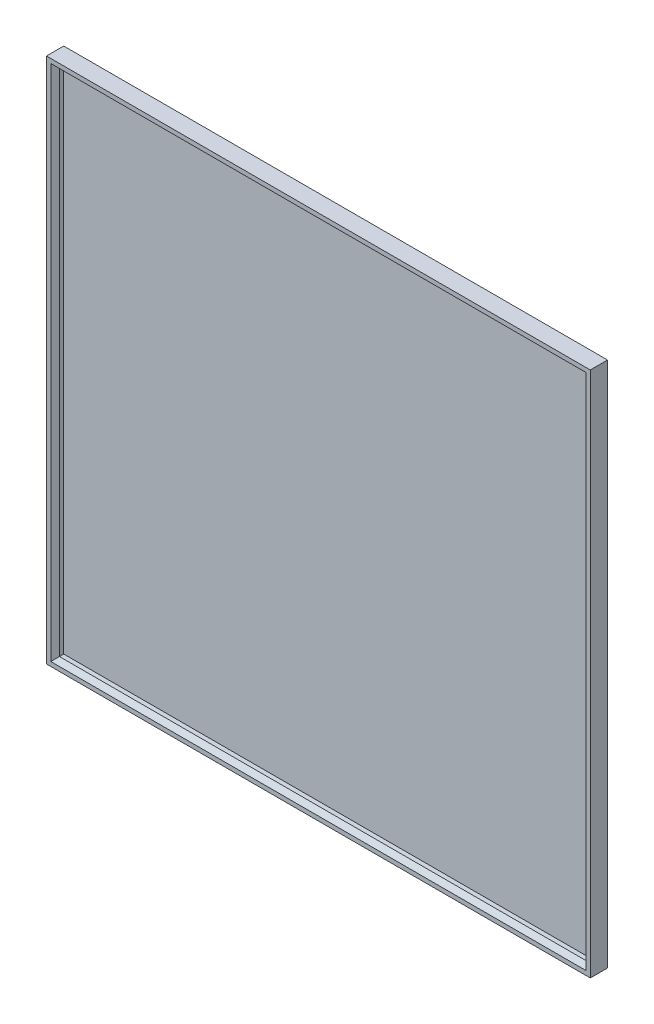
ISO-10303-21;
HEADER;
FILE_DESCRIPTION(('STEP AP214'),'2;1');
FILE_NAME('part.step','',(''),(''),'','','');
FILE_SCHEMA(('AUTOMOTIVE_DESIGN { 1 0 10303 214 1 1 1 1 }'));
ENDSEC;
DATA;
#1=APPLICATION_CONTEXT('core data for automotive mechanical design processes');
#2=APPLICATION_PROTOCOL_DEFINITION('international standard','automotive_design',2000,#1);
#3=PRODUCT_CONTEXT('',#1,'mechanical');
#4=PRODUCT('Part','Part','',(#3));
#5=PRODUCT_RELATED_PRODUCT_CATEGORY('part','',(#4));
#6=PRODUCT_DEFINITION_FORMATION('','',#4);
#7=PRODUCT_DEFINITION_CONTEXT('part definition',#1,'design');
#8=PRODUCT_DEFINITION('design','',#6,#7);
#9=PRODUCT_DEFINITION_SHAPE('','',#8);
#10=(LENGTH_UNIT() NAMED_UNIT(*) SI_UNIT(.MILLI.,.METRE.));
#11=(NAMED_UNIT(*) PLANE_ANGLE_UNIT() SI_UNIT($,.RADIAN.));
#12=(NAMED_UNIT(*) SI_UNIT($,.STERADIAN.) SOLID_ANGLE_UNIT());
#13=UNCERTAINTY_MEASURE_WITH_UNIT(LENGTH_MEASURE(1.E-05),#10,'distance_accuracy_value','');
#14=(GEOMETRIC_REPRESENTATION_CONTEXT(3) GLOBAL_UNCERTAINTY_ASSIGNED_CONTEXT((#13)) GLOBAL_UNIT_ASSIGNED_CONTEXT((#10,
#11,#12)) REPRESENTATION_CONTEXT('',''));
#15=CARTESIAN_POINT('',(0.,0.,0.));
#16=DIRECTION('',(0.,0.,1.));
#17=DIRECTION('',(1.,0.,0.));
#18=AXIS2_PLACEMENT_3D('',#15,#16,#17);
#19=CARTESIAN_POINT('',(0.,-610.,2.));
#20=DIRECTION('',(0.,0.,1.));
#21=DIRECTION('',(1.,0.,0.));
#22=AXIS2_PLACEMENT_3D('',#19,#20,#21);
#23=PLANE('',#22);
#24=CARTESIAN_POINT('',(60.,-180.,2.));
#25=DIRECTION('',(0.,0.,-1.));
#26=DIRECTION('',(-1.,0.,0.));
#27=AXIS2_PLACEMENT_3D('',#24,#25,#26);
#28=CIRCLE('',#27,10.);
#29=CARTESIAN_POINT('',(60.,-190.,2.));
#30=VERTEX_POINT('',#29);
#31=CARTESIAN_POINT('',(50.,-180.,2.));
#32=VERTEX_POINT('',#31);
#33=EDGE_CURVE('E466',#30,#32,#28,.T.);
#34=ORIENTED_EDGE('',*,*,#33,.F.);
#35=DIRECTION('',(-1.,0.,0.));
#36=VECTOR('',#35,1.);
#37=CARTESIAN_POINT('',(140.,-190.,2.));
#38=LINE('',#37,#36);
#39=CARTESIAN_POINT('',(140.,-190.,2.));
#40=VERTEX_POINT('',#39);
#41=EDGE_CURVE('E471',#40,#30,#38,.T.);
#42=ORIENTED_EDGE('',*,*,#41,.F.);
#43=CARTESIAN_POINT('',(140.,-180.,2.));
#44=DIRECTION('',(0.,0.,-1.));
#45=DIRECTION('',(1.,0.,0.));
#46=AXIS2_PLACEMENT_3D('',#43,#44,#45);
#47=CIRCLE('',#46,10.);
#48=CARTESIAN_POINT('',(150.,-180.,2.));
#49=VERTEX_POINT('',#48);
#50=EDGE_CURVE('E503',#49,#40,#47,.T.);
#51=ORIENTED_EDGE('',*,*,#50,.F.);
#52=DIRECTION('',(0.,-1.,0.));
#53=VECTOR('',#52,1.);
#54=CARTESIAN_POINT('',(150.,-160.,2.));
#55=LINE('',#54,#53);
#56=CARTESIAN_POINT('',(150.,-160.,2.));
#57=VERTEX_POINT('',#56);
#58=EDGE_CURVE('E500',#57,#49,#55,.T.);
#59=ORIENTED_EDGE('',*,*,#58,.F.);
#60=CARTESIAN_POINT('',(140.,-160.,2.));
#61=DIRECTION('',(0.,0.,-1.));
#62=DIRECTION('',(1.,0.,0.));
#63=AXIS2_PLACEMENT_3D('',#60,#61,#62);
#64=CIRCLE('',#63,10.);
#65=CARTESIAN_POINT('',(140.,-150.,2.));
#66=VERTEX_POINT('',#65);
#67=EDGE_CURVE('E497',#66,#57,#64,.T.);
#68=ORIENTED_EDGE('',*,*,#67,.F.);
#69=DIRECTION('',(1.,0.,0.));
#70=VECTOR('',#69,1.);
#71=CARTESIAN_POINT('',(140.,-150.,2.));
#72=LINE('',#71,#70);
#73=CARTESIAN_POINT('',(60.,-150.,2.));
#74=VERTEX_POINT('',#73);
#75=EDGE_CURVE('E494',#74,#66,#72,.T.);
#76=ORIENTED_EDGE('',*,*,#75,.F.);
#77=CARTESIAN_POINT('',(60.,-160.,2.));
#78=DIRECTION('',(0.,0.,-1.));
#79=DIRECTION('',(-1.,0.,0.));
#80=AXIS2_PLACEMENT_3D('',#77,#78,#79);
#81=CIRCLE('',#80,10.);
#82=CARTESIAN_POINT('',(50.,-160.,2.));
#83=VERTEX_POINT('',#82);
#84=EDGE_CURVE('E491',#83,#74,#81,.T.);
#85=ORIENTED_EDGE('',*,*,#84,.F.);
#86=DIRECTION('',(0.,1.,0.));
#87=VECTOR('',#86,1.);
#88=CARTESIAN_POINT('',(50.,-160.,2.));
#89=LINE('',#88,#87);
#90=EDGE_CURVE('E488',#32,#83,#89,.T.);
#91=ORIENTED_EDGE('',*,*,#90,.F.);
#92=EDGE_LOOP('',(#34,#42,#51,#59,#68,#76,#85,#91));
#93=FACE_BOUND('',#92,.T.);
#94=DIRECTION('',(0.,1.,0.));
#95=VECTOR('',#94,1.);
#96=CARTESIAN_POINT('',(620.,0.,2.));
#97=LINE('',#96,#95);
#98=CARTESIAN_POINT('',(620.,-600.,2.));
#99=VERTEX_POINT('',#98);
#100=CARTESIAN_POINT('',(620.,-10.,2.));
#101=VERTEX_POINT('',#100);
#102=EDGE_CURVE('E559',#99,#101,#97,.T.);
#103=ORIENTED_EDGE('',*,*,#102,.F.);
#104=DIRECTION('',(1.,0.,0.));
#105=VECTOR('',#104,1.);
#106=CARTESIAN_POINT('',(0.,-600.,2.));
#107=LINE('',#106,#105);
#108=CARTESIAN_POINT('',(10.0000000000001,-600.,2.));
#109=VERTEX_POINT('',#108);
#110=EDGE_CURVE('E556',#109,#99,#107,.T.);
#111=ORIENTED_EDGE('',*,*,#110,.F.);
#112=DIRECTION('',(0.,-1.,0.));
#113=VECTOR('',#112,1.);
#114=CARTESIAN_POINT('',(10.,0.,2.));
#115=LINE('',#114,#113);
#116=CARTESIAN_POINT('',(10.,-10.,2.));
#117=VERTEX_POINT('',#116);
#118=EDGE_CURVE('E534',#117,#109,#115,.T.);
#119=ORIENTED_EDGE('',*,*,#118,.F.);
#120=DIRECTION('',(-1.,0.,0.));
#121=VECTOR('',#120,1.);
#122=CARTESIAN_POINT('',(0.,-10.,2.));
#123=LINE('',#122,#121);
#124=EDGE_CURVE('E562',#101,#117,#123,.T.);
#125=ORIENTED_EDGE('',*,*,#124,.F.);
#126=EDGE_LOOP('',(#103,#111,#119,#125));
#127=FACE_BOUND('',#126,.T.);
#128=CARTESIAN_POINT('',(490.,-180.,2.));
#129=DIRECTION('',(0.,0.,-1.));
#130=DIRECTION('',(1.,0.,0.));
#131=AXIS2_PLACEMENT_3D('',#128,#129,#130);
#132=CIRCLE('',#131,10.);
#133=CARTESIAN_POINT('',(490.,-190.,2.));
#134=VERTEX_POINT('',#133);
#135=CARTESIAN_POINT('',(480.,-180.,2.));
#136=VERTEX_POINT('',#135);
#137=EDGE_CURVE('E392',#134,#136,#132,.T.);
#138=ORIENTED_EDGE('',*,*,#137,.F.);
#139=DIRECTION('',(-1.,0.,0.));
#140=VECTOR('',#139,1.);
#141=CARTESIAN_POINT('',(570.,-190.,2.));
#142=LINE('',#141,#140);
#143=CARTESIAN_POINT('',(570.,-190.,2.));
#144=VERTEX_POINT('',#143);
#145=EDGE_CURVE('E406',#144,#134,#142,.T.);
#146=ORIENTED_EDGE('',*,*,#145,.F.);
#147=CARTESIAN_POINT('',(570.,-180.,2.));
#148=DIRECTION('',(0.,0.,-1.));
#149=DIRECTION('',(-1.,0.,0.));
#150=AXIS2_PLACEMENT_3D('',#147,#148,#149);
#151=CIRCLE('',#150,10.);
#152=CARTESIAN_POINT('',(580.,-180.,2.));
#153=VERTEX_POINT('',#152);
#154=EDGE_CURVE('E438',#153,#144,#151,.T.);
#155=ORIENTED_EDGE('',*,*,#154,.F.);
#156=DIRECTION('',(0.,-1.,0.));
#157=VECTOR('',#156,1.);
#158=CARTESIAN_POINT('',(580.,-160.,2.));
#159=LINE('',#158,#157);
#160=CARTESIAN_POINT('',(580.,-160.,2.));
#161=VERTEX_POINT('',#160);
#162=EDGE_CURVE('E435',#161,#153,#159,.T.);
#163=ORIENTED_EDGE('',*,*,#162,.F.);
#164=CARTESIAN_POINT('',(570.,-160.,2.));
#165=DIRECTION('',(0.,0.,-1.));
#166=DIRECTION('',(1.,0.,0.));
#167=AXIS2_PLACEMENT_3D('',#164,#165,#166);
#168=CIRCLE('',#167,10.0000000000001);
#169=CARTESIAN_POINT('',(570.,-150.,2.));
#170=VERTEX_POINT('',#169);
#171=EDGE_CURVE('E432',#170,#161,#168,.T.);
#172=ORIENTED_EDGE('',*,*,#171,.F.);
#173=DIRECTION('',(1.,0.,0.));
#174=VECTOR('',#173,1.);
#175=CARTESIAN_POINT('',(570.,-150.,2.));
#176=LINE('',#175,#174);
#177=CARTESIAN_POINT('',(490.,-150.,2.));
#178=VERTEX_POINT('',#177);
#179=EDGE_CURVE('E429',#178,#170,#176,.T.);
#180=ORIENTED_EDGE('',*,*,#179,.F.);
#181=CARTESIAN_POINT('',(490.,-160.,2.));
#182=DIRECTION('',(0.,0.,-1.));
#183=DIRECTION('',(-1.,0.,0.));
#184=AXIS2_PLACEMENT_3D('',#181,#182,#183);
#185=CIRCLE('',#184,10.);
#186=CARTESIAN_POINT('',(480.,-160.,2.));
#187=VERTEX_POINT('',#186);
#188=EDGE_CURVE('E426',#187,#178,#185,.T.);
#189=ORIENTED_EDGE('',*,*,#188,.F.);
#190=DIRECTION('',(0.,1.,0.));
#191=VECTOR('',#190,1.);
#192=CARTESIAN_POINT('',(480.,-160.,2.));
#193=LINE('',#192,#191);
#194=EDGE_CURVE('E423',#136,#187,#193,.T.);
#195=ORIENTED_EDGE('',*,*,#194,.F.);
#196=EDGE_LOOP('',(#138,#146,#155,#163,#172,#180,#189,#195));
#197=FACE_BOUND('',#196,.T.);
#198=ADVANCED_FACE('F31',(#93,#127,#197),#23,.F.);
#199=CARTESIAN_POINT('',(0.,0.,20.));
#200=DIRECTION('',(1.,0.,0.));
#201=DIRECTION('',(0.,1.,0.));
#202=AXIS2_PLACEMENT_3D('',#199,#200,#201);
#203=PLANE('',#202);
#204=DIRECTION('',(0.,-1.,0.));
#205=VECTOR('',#204,1.);
#206=CARTESIAN_POINT('',(0.,0.,0.));
#207=LINE('',#206,#205);
#208=CARTESIAN_POINT('',(0.,0.,0.));
#209=VERTEX_POINT('',#208);
#210=CARTESIAN_POINT('',(0.,-610.,0.));
#211=VERTEX_POINT('',#210);
#212=EDGE_CURVE('E570',#209,#211,#207,.T.);
#213=ORIENTED_EDGE('',*,*,#212,.T.);
#214=DIRECTION('',(0.,0.,-1.));
#215=VECTOR('',#214,1.);
#216=CARTESIAN_POINT('',(0.,-610.,20.));
#217=LINE('',#216,#215);
#218=CARTESIAN_POINT('',(0.,-610.,20.));
#219=VERTEX_POINT('',#218);
#220=EDGE_CURVE('E611',#219,#211,#217,.T.);
#221=ORIENTED_EDGE('',*,*,#220,.F.);
#222=DIRECTION('',(0.,-1.,0.));
#223=VECTOR('',#222,1.);
#224=CARTESIAN_POINT('',(0.,0.,20.));
#225=LINE('',#224,#223);
#226=CARTESIAN_POINT('',(0.,0.,20.));
#227=VERTEX_POINT('',#226);
#228=EDGE_CURVE('E585',#227,#219,#225,.T.);
#229=ORIENTED_EDGE('',*,*,#228,.F.);
#230=DIRECTION('',(0.,0.,-1.));
#231=VECTOR('',#230,1.);
#232=CARTESIAN_POINT('',(0.,0.,20.));
#233=LINE('',#232,#231);
#234=EDGE_CURVE('E595',#227,#209,#233,.T.);
#235=ORIENTED_EDGE('',*,*,#234,.T.);
#236=EDGE_LOOP('',(#213,#221,#229,#235));
#237=FACE_BOUND('',#236,.T.);
#238=ADVANCED_FACE('F686',(#237),#203,.F.);
#239=CARTESIAN_POINT('',(0.,-610.,20.));
#240=DIRECTION('',(0.,1.,0.));
#241=DIRECTION('',(0.,0.,1.));
#242=AXIS2_PLACEMENT_3D('',#239,#240,#241);
#243=PLANE('',#242);
#244=DIRECTION('',(1.,0.,0.));
#245=VECTOR('',#244,1.);
#246=CARTESIAN_POINT('',(0.,-610.,0.));
#247=LINE('',#246,#245);
#248=CARTESIAN_POINT('',(630.,-610.,0.));
#249=VERTEX_POINT('',#248);
#250=EDGE_CURVE('E598',#211,#249,#247,.T.);
#251=ORIENTED_EDGE('',*,*,#250,.T.);
#252=DIRECTION('',(0.,0.,-1.));
#253=VECTOR('',#252,1.);
#254=CARTESIAN_POINT('',(630.,-610.,20.));
#255=LINE('',#254,#253);
#256=CARTESIAN_POINT('',(630.,-610.,20.));
#257=VERTEX_POINT('',#256);
#258=EDGE_CURVE('E608',#257,#249,#255,.T.);
#259=ORIENTED_EDGE('',*,*,#258,.F.);
#260=DIRECTION('',(1.,0.,0.));
#261=VECTOR('',#260,1.);
#262=CARTESIAN_POINT('',(0.,-610.,20.));
#263=LINE('',#262,#261);
#264=EDGE_CURVE('E588',#219,#257,#263,.T.);
#265=ORIENTED_EDGE('',*,*,#264,.F.);
#266=ORIENTED_EDGE('',*,*,#220,.T.);
#267=EDGE_LOOP('',(#251,#259,#265,#266));
#268=FACE_BOUND('',#267,.T.);
#269=ADVANCED_FACE('F691',(#268),#243,.F.);
#270=CARTESIAN_POINT('',(630.,0.,20.));
#271=DIRECTION('',(-1.,0.,0.));
#272=DIRECTION('',(0.,-1.,0.));
#273=AXIS2_PLACEMENT_3D('',#270,#271,#272);
#274=PLANE('',#273);
#275=DIRECTION('',(0.,1.,0.));
#276=VECTOR('',#275,1.);
#277=CARTESIAN_POINT('',(630.,0.,0.));
#278=LINE('',#277,#276);
#279=CARTESIAN_POINT('',(630.,0.,0.));
#280=VERTEX_POINT('',#279);
#281=EDGE_CURVE('E600',#249,#280,#278,.T.);
#282=ORIENTED_EDGE('',*,*,#281,.T.);
#283=DIRECTION('',(0.,0.,-1.));
#284=VECTOR('',#283,1.);
#285=CARTESIAN_POINT('',(630.,0.,20.));
#286=LINE('',#285,#284);
#287=CARTESIAN_POINT('',(630.,0.,20.));
#288=VERTEX_POINT('',#287);
#289=EDGE_CURVE('E605',#288,#280,#286,.T.);
#290=ORIENTED_EDGE('',*,*,#289,.F.);
#291=DIRECTION('',(0.,1.,0.));
#292=VECTOR('',#291,1.);
#293=CARTESIAN_POINT('',(630.,0.,20.));
#294=LINE('',#293,#292);
#295=EDGE_CURVE('E591',#257,#288,#294,.T.);
#296=ORIENTED_EDGE('',*,*,#295,.F.);
#297=ORIENTED_EDGE('',*,*,#258,.T.);
#298=EDGE_LOOP('',(#282,#290,#296,#297));
#299=FACE_BOUND('',#298,.T.);
#300=ADVANCED_FACE('F1046',(#299),#274,.F.);
#301=CARTESIAN_POINT('',(0.,0.,20.));
#302=DIRECTION('',(0.,-1.,0.));
#303=DIRECTION('',(0.,0.,-1.));
#304=AXIS2_PLACEMENT_3D('',#301,#302,#303);
#305=PLANE('',#304);
#306=DIRECTION('',(-1.,0.,0.));
#307=VECTOR('',#306,1.);
#308=CARTESIAN_POINT('',(0.,0.,0.));
#309=LINE('',#308,#307);
#310=EDGE_CURVE('E589',#280,#209,#309,.T.);
#311=ORIENTED_EDGE('',*,*,#310,.T.);
#312=ORIENTED_EDGE('',*,*,#234,.F.);
#313=DIRECTION('',(-1.,0.,0.));
#314=VECTOR('',#313,1.);
#315=CARTESIAN_POINT('',(0.,0.,20.));
#316=LINE('',#315,#314);
#317=EDGE_CURVE('E593',#288,#227,#316,.T.);
#318=ORIENTED_EDGE('',*,*,#317,.F.);
#319=ORIENTED_EDGE('',*,*,#289,.T.);
#320=EDGE_LOOP('',(#311,#312,#318,#319));
#321=FACE_BOUND('',#320,.T.);
#322=ADVANCED_FACE('F1033',(#321),#305,.F.);
#323=CARTESIAN_POINT('',(0.,-610.,20.));
#324=DIRECTION('',(0.,0.,1.));
#325=DIRECTION('',(1.,0.,0.));
#326=AXIS2_PLACEMENT_3D('',#323,#324,#325);
#327=PLANE('',#326);
#328=DIRECTION('',(0.,-1.,0.));
#329=VECTOR('',#328,1.);
#330=CARTESIAN_POINT('',(625.,-610.,20.));
#331=LINE('',#330,#329);
#332=CARTESIAN_POINT('',(625.,-5.,20.));
#333=VERTEX_POINT('',#332);
#334=CARTESIAN_POINT('',(625.,-605.,20.));
#335=VERTEX_POINT('',#334);
#336=EDGE_CURVE('E621',#333,#335,#331,.T.);
#337=ORIENTED_EDGE('',*,*,#336,.T.);
#338=DIRECTION('',(-1.,0.,0.));
#339=VECTOR('',#338,1.);
#340=CARTESIAN_POINT('',(0.,-605.,20.));
#341=LINE('',#340,#339);
#342=CARTESIAN_POINT('',(5.00000000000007,-605.,20.));
#343=VERTEX_POINT('',#342);
#344=EDGE_CURVE('E623',#335,#343,#341,.T.);
#345=ORIENTED_EDGE('',*,*,#344,.T.);
#346=DIRECTION('',(0.,1.,0.));
#347=VECTOR('',#346,1.);
#348=CARTESIAN_POINT('',(5.00000000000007,-610.,20.));
#349=LINE('',#348,#347);
#350=CARTESIAN_POINT('',(5.,-5.,20.));
#351=VERTEX_POINT('',#350);
#352=EDGE_CURVE('E619',#343,#351,#349,.T.);
#353=ORIENTED_EDGE('',*,*,#352,.T.);
#354=DIRECTION('',(1.,0.,0.));
#355=VECTOR('',#354,1.);
#356=CARTESIAN_POINT('',(0.,-5.,20.));
#357=LINE('',#356,#355);
#358=EDGE_CURVE('E617',#351,#333,#357,.T.);
#359=ORIENTED_EDGE('',*,*,#358,.T.);
#360=EDGE_LOOP('',(#337,#345,#353,#359));
#361=FACE_BOUND('',#360,.T.);
#362=ORIENTED_EDGE('',*,*,#228,.T.);
#363=ORIENTED_EDGE('',*,*,#264,.T.);
#364=ORIENTED_EDGE('',*,*,#295,.T.);
#365=ORIENTED_EDGE('',*,*,#317,.T.);
#366=EDGE_LOOP('',(#362,#363,#364,#365));
#367=FACE_BOUND('',#366,.T.);
#368=ADVANCED_FACE('F648',(#361,#367),#327,.T.);
#369=CARTESIAN_POINT('',(0.,-610.,0.));
#370=DIRECTION('',(0.,0.,1.));
#371=DIRECTION('',(1.,0.,0.));
#372=AXIS2_PLACEMENT_3D('',#369,#370,#371);
#373=PLANE('',#372);
#374=DIRECTION('',(-1.,0.,0.));
#375=VECTOR('',#374,1.);
#376=CARTESIAN_POINT('',(0.,-10.,0.));
#377=LINE('',#376,#375);
#378=CARTESIAN_POINT('',(620.,-10.,0.));
#379=VERTEX_POINT('',#378);
#380=CARTESIAN_POINT('',(10.,-10.,0.));
#381=VERTEX_POINT('',#380);
#382=EDGE_CURVE('E539',#379,#381,#377,.T.);
#383=ORIENTED_EDGE('',*,*,#382,.T.);
#384=DIRECTION('',(0.,-1.,0.));
#385=VECTOR('',#384,1.);
#386=CARTESIAN_POINT('',(10.,0.,0.));
#387=LINE('',#386,#385);
#388=CARTESIAN_POINT('',(10.0000000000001,-600.,0.));
#389=VERTEX_POINT('',#388);
#390=EDGE_CURVE('E543',#381,#389,#387,.T.);
#391=ORIENTED_EDGE('',*,*,#390,.T.);
#392=DIRECTION('',(1.,0.,0.));
#393=VECTOR('',#392,1.);
#394=CARTESIAN_POINT('',(0.,-600.,0.));
#395=LINE('',#394,#393);
#396=CARTESIAN_POINT('',(620.,-600.,0.));
#397=VERTEX_POINT('',#396);
#398=EDGE_CURVE('E546',#389,#397,#395,.T.);
#399=ORIENTED_EDGE('',*,*,#398,.T.);
#400=DIRECTION('',(0.,1.,0.));
#401=VECTOR('',#400,1.);
#402=CARTESIAN_POINT('',(620.,0.,0.));
#403=LINE('',#402,#401);
#404=EDGE_CURVE('E549',#397,#379,#403,.T.);
#405=ORIENTED_EDGE('',*,*,#404,.T.);
#406=EDGE_LOOP('',(#383,#391,#399,#405));
#407=FACE_BOUND('',#406,.T.);
#408=ORIENTED_EDGE('',*,*,#212,.F.);
#409=ORIENTED_EDGE('',*,*,#310,.F.);
#410=ORIENTED_EDGE('',*,*,#281,.F.);
#411=ORIENTED_EDGE('',*,*,#250,.F.);
#412=EDGE_LOOP('',(#408,#409,#410,#411));
#413=FACE_BOUND('',#412,.T.);
#414=ADVANCED_FACE('F675',(#407,#413),#373,.F.);
#415=CARTESIAN_POINT('',(10.,0.,20.));
#416=DIRECTION('',(1.,0.,0.));
#417=DIRECTION('',(0.,1.,0.));
#418=AXIS2_PLACEMENT_3D('',#415,#416,#417);
#419=PLANE('',#418);
#420=DIRECTION('',(0.,0.,-1.));
#421=VECTOR('',#420,1.);
#422=CARTESIAN_POINT('',(10.,-10.,20.));
#423=LINE('',#422,#421);
#424=CARTESIAN_POINT('',(10.,-10.,15.));
#425=VERTEX_POINT('',#424);
#426=CARTESIAN_POINT('',(10.,-10.,10.));
#427=VERTEX_POINT('',#426);
#428=EDGE_CURVE('E572',#425,#427,#423,.T.);
#429=ORIENTED_EDGE('',*,*,#428,.F.);
#430=DIRECTION('',(0.,-1.,0.));
#431=VECTOR('',#430,1.);
#432=CARTESIAN_POINT('',(10.,0.,15.));
#433=LINE('',#432,#431);
#434=CARTESIAN_POINT('',(10.0000000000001,-600.,15.));
#435=VERTEX_POINT('',#434);
#436=EDGE_CURVE('E40',#425,#435,#433,.T.);
#437=ORIENTED_EDGE('',*,*,#436,.T.);
#438=DIRECTION('',(0.,0.,-1.));
#439=VECTOR('',#438,1.);
#440=CARTESIAN_POINT('',(10.0000000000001,-600.,20.));
#441=LINE('',#440,#439);
#442=CARTESIAN_POINT('',(10.0000000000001,-600.,10.));
#443=VERTEX_POINT('',#442);
#444=EDGE_CURVE('E568',#435,#443,#441,.T.);
#445=ORIENTED_EDGE('',*,*,#444,.T.);
#446=DIRECTION('',(0.,-1.,0.));
#447=VECTOR('',#446,1.);
#448=CARTESIAN_POINT('',(10.,0.,10.));
#449=LINE('',#448,#447);
#450=EDGE_CURVE('E564',#427,#443,#449,.T.);
#451=ORIENTED_EDGE('',*,*,#450,.F.);
#452=EDGE_LOOP('',(#429,#437,#445,#451));
#453=FACE_BOUND('',#452,.T.);
#454=ADVANCED_FACE('F673',(#453),#419,.T.);
#455=CARTESIAN_POINT('',(0.,-600.,20.));
#456=DIRECTION('',(0.,1.,0.));
#457=DIRECTION('',(0.,0.,1.));
#458=AXIS2_PLACEMENT_3D('',#455,#456,#457);
#459=PLANE('',#458);
#460=ORIENTED_EDGE('',*,*,#444,.F.);
#461=DIRECTION('',(1.,0.,0.));
#462=VECTOR('',#461,1.);
#463=CARTESIAN_POINT('',(0.,-600.,15.));
#464=LINE('',#463,#462);
#465=CARTESIAN_POINT('',(620.,-600.,15.));
#466=VERTEX_POINT('',#465);
#467=EDGE_CURVE('E614',#435,#466,#464,.T.);
#468=ORIENTED_EDGE('',*,*,#467,.T.);
#469=DIRECTION('',(0.,0.,-1.));
#470=VECTOR('',#469,1.);
#471=CARTESIAN_POINT('',(620.,-600.,20.));
#472=LINE('',#471,#470);
#473=CARTESIAN_POINT('',(620.,-600.,10.));
#474=VERTEX_POINT('',#473);
#475=EDGE_CURVE('E571',#466,#474,#472,.T.);
#476=ORIENTED_EDGE('',*,*,#475,.T.);
#477=DIRECTION('',(1.,0.,0.));
#478=VECTOR('',#477,1.);
#479=CARTESIAN_POINT('',(0.,-600.,10.));
#480=LINE('',#479,#478);
#481=EDGE_CURVE('E567',#443,#474,#480,.T.);
#482=ORIENTED_EDGE('',*,*,#481,.F.);
#483=EDGE_LOOP('',(#460,#468,#476,#482));
#484=FACE_BOUND('',#483,.T.);
#485=ADVANCED_FACE('F661',(#484),#459,.T.);
#486=CARTESIAN_POINT('',(620.,0.,20.));
#487=DIRECTION('',(-1.,0.,0.));
#488=DIRECTION('',(0.,-1.,0.));
#489=AXIS2_PLACEMENT_3D('',#486,#487,#488);
#490=PLANE('',#489);
#491=ORIENTED_EDGE('',*,*,#475,.F.);
#492=DIRECTION('',(0.,1.,0.));
#493=VECTOR('',#492,1.);
#494=CARTESIAN_POINT('',(620.,0.,15.));
#495=LINE('',#494,#493);
#496=CARTESIAN_POINT('',(620.,-10.,15.));
#497=VERTEX_POINT('',#496);
#498=EDGE_CURVE('E626',#466,#497,#495,.T.);
#499=ORIENTED_EDGE('',*,*,#498,.T.);
#500=DIRECTION('',(0.,0.,-1.));
#501=VECTOR('',#500,1.);
#502=CARTESIAN_POINT('',(620.,-10.,20.));
#503=LINE('',#502,#501);
#504=CARTESIAN_POINT('',(620.,-10.,10.));
#505=VERTEX_POINT('',#504);
#506=EDGE_CURVE('E574',#497,#505,#503,.T.);
#507=ORIENTED_EDGE('',*,*,#506,.T.);
#508=DIRECTION('',(0.,1.,0.));
#509=VECTOR('',#508,1.);
#510=CARTESIAN_POINT('',(620.,0.,10.));
#511=LINE('',#510,#509);
#512=EDGE_CURVE('E578',#474,#505,#511,.T.);
#513=ORIENTED_EDGE('',*,*,#512,.F.);
#514=EDGE_LOOP('',(#491,#499,#507,#513));
#515=FACE_BOUND('',#514,.T.);
#516=ADVANCED_FACE('F664',(#515),#490,.T.);
#517=CARTESIAN_POINT('',(0.,-10.,20.));
#518=DIRECTION('',(0.,-1.,0.));
#519=DIRECTION('',(0.,0.,-1.));
#520=AXIS2_PLACEMENT_3D('',#517,#518,#519);
#521=PLANE('',#520);
#522=ORIENTED_EDGE('',*,*,#506,.F.);
#523=DIRECTION('',(-1.,0.,0.));
#524=VECTOR('',#523,1.);
#525=CARTESIAN_POINT('',(0.,-10.,15.));
#526=LINE('',#525,#524);
#527=EDGE_CURVE('E11',#497,#425,#526,.T.);
#528=ORIENTED_EDGE('',*,*,#527,.T.);
#529=ORIENTED_EDGE('',*,*,#428,.T.);
#530=DIRECTION('',(-1.,0.,0.));
#531=VECTOR('',#530,1.);
#532=CARTESIAN_POINT('',(0.,-10.,10.));
#533=LINE('',#532,#531);
#534=EDGE_CURVE('E575',#505,#427,#533,.T.);
#535=ORIENTED_EDGE('',*,*,#534,.F.);
#536=EDGE_LOOP('',(#522,#528,#529,#535));
#537=FACE_BOUND('',#536,.T.);
#538=ADVANCED_FACE('F670',(#537),#521,.T.);
#539=CARTESIAN_POINT('',(0.,-610.,10.));
#540=DIRECTION('',(0.,0.,1.));
#541=DIRECTION('',(1.,0.,0.));
#542=AXIS2_PLACEMENT_3D('',#539,#540,#541);
#543=PLANE('',#542);
#544=ORIENTED_EDGE('',*,*,#450,.T.);
#545=ORIENTED_EDGE('',*,*,#481,.T.);
#546=ORIENTED_EDGE('',*,*,#512,.T.);
#547=ORIENTED_EDGE('',*,*,#534,.T.);
#548=EDGE_LOOP('',(#544,#545,#546,#547));
#549=FACE_BOUND('',#548,.T.);
#550=ADVANCED_FACE('F667',(#549),#543,.T.);
#551=CARTESIAN_POINT('',(10.,0.,20.));
#552=DIRECTION('',(1.,0.,0.));
#553=DIRECTION('',(0.,1.,0.));
#554=AXIS2_PLACEMENT_3D('',#551,#552,#553);
#555=PLANE('',#554);
#556=ORIENTED_EDGE('',*,*,#118,.T.);
#557=DIRECTION('',(0.,0.,-1.));
#558=VECTOR('',#557,1.);
#559=CARTESIAN_POINT('',(10.0000000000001,-600.,20.));
#560=LINE('',#559,#558);
#561=EDGE_CURVE('E532',#109,#389,#560,.T.);
#562=ORIENTED_EDGE('',*,*,#561,.T.);
#563=ORIENTED_EDGE('',*,*,#390,.F.);
#564=DIRECTION('',(0.,0.,-1.));
#565=VECTOR('',#564,1.);
#566=CARTESIAN_POINT('',(10.,-10.,20.));
#567=LINE('',#566,#565);
#568=EDGE_CURVE('E536',#117,#381,#567,.T.);
#569=ORIENTED_EDGE('',*,*,#568,.F.);
#570=EDGE_LOOP('',(#556,#562,#563,#569));
#571=FACE_BOUND('',#570,.T.);
#572=ADVANCED_FACE('F707',(#571),#555,.T.);
#573=CARTESIAN_POINT('',(0.,-600.,20.));
#574=DIRECTION('',(0.,1.,0.));
#575=DIRECTION('',(0.,0.,1.));
#576=AXIS2_PLACEMENT_3D('',#573,#574,#575);
#577=PLANE('',#576);
#578=ORIENTED_EDGE('',*,*,#110,.T.);
#579=DIRECTION('',(0.,0.,-1.));
#580=VECTOR('',#579,1.);
#581=CARTESIAN_POINT('',(620.,-600.,20.));
#582=LINE('',#581,#580);
#583=EDGE_CURVE('E535',#99,#397,#582,.T.);
#584=ORIENTED_EDGE('',*,*,#583,.T.);
#585=ORIENTED_EDGE('',*,*,#398,.F.);
#586=ORIENTED_EDGE('',*,*,#561,.F.);
#587=EDGE_LOOP('',(#578,#584,#585,#586));
#588=FACE_BOUND('',#587,.T.);
#589=ADVANCED_FACE('F703',(#588),#577,.T.);
#590=CARTESIAN_POINT('',(620.,0.,20.));
#591=DIRECTION('',(-1.,0.,0.));
#592=DIRECTION('',(0.,-1.,0.));
#593=AXIS2_PLACEMENT_3D('',#590,#591,#592);
#594=PLANE('',#593);
#595=ORIENTED_EDGE('',*,*,#102,.T.);
#596=DIRECTION('',(0.,0.,-1.));
#597=VECTOR('',#596,1.);
#598=CARTESIAN_POINT('',(620.,-10.,20.));
#599=LINE('',#598,#597);
#600=EDGE_CURVE('E538',#101,#379,#599,.T.);
#601=ORIENTED_EDGE('',*,*,#600,.T.);
#602=ORIENTED_EDGE('',*,*,#404,.F.);
#603=ORIENTED_EDGE('',*,*,#583,.F.);
#604=EDGE_LOOP('',(#595,#601,#602,#603));
#605=FACE_BOUND('',#604,.T.);
#606=ADVANCED_FACE('F699',(#605),#594,.T.);
#607=CARTESIAN_POINT('',(0.,-10.,20.));
#608=DIRECTION('',(0.,-1.,0.));
#609=DIRECTION('',(0.,0.,-1.));
#610=AXIS2_PLACEMENT_3D('',#607,#608,#609);
#611=PLANE('',#610);
#612=ORIENTED_EDGE('',*,*,#124,.T.);
#613=ORIENTED_EDGE('',*,*,#568,.T.);
#614=ORIENTED_EDGE('',*,*,#382,.F.);
#615=ORIENTED_EDGE('',*,*,#600,.F.);
#616=EDGE_LOOP('',(#612,#613,#614,#615));
#617=FACE_BOUND('',#616,.T.);
#618=ADVANCED_FACE('F696',(#617),#611,.T.);
#619=CARTESIAN_POINT('',(0.,-10.,15.));
#620=DIRECTION('',(0.,0.707106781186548,-0.707106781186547));
#621=DIRECTION('',(0.,0.707106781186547,0.707106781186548));
#622=AXIS2_PLACEMENT_3D('',#619,#620,#621);
#623=PLANE('',#622);
#624=DIRECTION('',(0.577350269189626,0.577350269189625,0.577350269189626));
#625=VECTOR('',#624,1.);
#626=CARTESIAN_POINT('',(623.333333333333,-6.66666666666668,18.3333333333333));
#627=LINE('',#626,#625);
#628=EDGE_CURVE('E631',#333,#497,#627,.F.);
#629=ORIENTED_EDGE('',*,*,#628,.F.);
#630=ORIENTED_EDGE('',*,*,#358,.F.);
#631=DIRECTION('',(0.577350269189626,-0.577350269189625,-0.577350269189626));
#632=VECTOR('',#631,1.);
#633=CARTESIAN_POINT('',(6.66666666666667,-6.66666666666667,18.3333333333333));
#634=LINE('',#633,#632);
#635=EDGE_CURVE('E35',#425,#351,#634,.F.);
#636=ORIENTED_EDGE('',*,*,#635,.F.);
#637=ORIENTED_EDGE('',*,*,#527,.F.);
#638=EDGE_LOOP('',(#629,#630,#636,#637));
#639=FACE_BOUND('',#638,.T.);
#640=ADVANCED_FACE('F33',(#639),#623,.F.);
#641=CARTESIAN_POINT('',(10.,0.,15.));
#642=DIRECTION('',(-0.707106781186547,0.,-0.707106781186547));
#643=DIRECTION('',(-0.707106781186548,0.,0.707106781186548));
#644=AXIS2_PLACEMENT_3D('',#641,#642,#643);
#645=PLANE('',#644);
#646=ORIENTED_EDGE('',*,*,#635,.T.);
#647=ORIENTED_EDGE('',*,*,#352,.F.);
#648=DIRECTION('',(0.577350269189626,0.577350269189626,-0.577350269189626));
#649=VECTOR('',#648,1.);
#650=CARTESIAN_POINT('',(6.66666666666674,-603.333333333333,18.3333333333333));
#651=LINE('',#650,#649);
#652=EDGE_CURVE('E630',#435,#343,#651,.F.);
#653=ORIENTED_EDGE('',*,*,#652,.F.);
#654=ORIENTED_EDGE('',*,*,#436,.F.);
#655=EDGE_LOOP('',(#646,#647,#653,#654));
#656=FACE_BOUND('',#655,.T.);
#657=ADVANCED_FACE('F642',(#656),#645,.F.);
#658=CARTESIAN_POINT('',(620.,0.,15.));
#659=DIRECTION('',(0.707106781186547,0.,-0.707106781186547));
#660=DIRECTION('',(-0.707106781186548,0.,-0.707106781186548));
#661=AXIS2_PLACEMENT_3D('',#658,#659,#660);
#662=PLANE('',#661);
#663=ORIENTED_EDGE('',*,*,#628,.T.);
#664=ORIENTED_EDGE('',*,*,#498,.F.);
#665=DIRECTION('',(0.577350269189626,-0.577350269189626,0.577350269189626));
#666=VECTOR('',#665,1.);
#667=CARTESIAN_POINT('',(413.333333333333,-393.333333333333,-191.666666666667));
#668=LINE('',#667,#666);
#669=EDGE_CURVE('E531',#335,#466,#668,.F.);
#670=ORIENTED_EDGE('',*,*,#669,.F.);
#671=ORIENTED_EDGE('',*,*,#336,.F.);
#672=EDGE_LOOP('',(#663,#664,#670,#671));
#673=FACE_BOUND('',#672,.T.);
#674=ADVANCED_FACE('F655',(#673),#662,.F.);
#675=CARTESIAN_POINT('',(0.,-600.,15.));
#676=DIRECTION('',(0.,-0.707106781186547,-0.707106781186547));
#677=DIRECTION('',(0.,0.707106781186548,-0.707106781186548));
#678=AXIS2_PLACEMENT_3D('',#675,#676,#677);
#679=PLANE('',#678);
#680=ORIENTED_EDGE('',*,*,#652,.T.);
#681=ORIENTED_EDGE('',*,*,#344,.F.);
#682=ORIENTED_EDGE('',*,*,#669,.T.);
#683=ORIENTED_EDGE('',*,*,#467,.F.);
#684=EDGE_LOOP('',(#680,#681,#682,#683));
#685=FACE_BOUND('',#684,.T.);
#686=ADVANCED_FACE('F653',(#685),#679,.F.);
#687=CARTESIAN_POINT('',(60.,-180.,-18.));
#688=DIRECTION('',(0.,0.,1.));
#689=DIRECTION('',(1.,0.,0.));
#690=AXIS2_PLACEMENT_3D('',#687,#688,#689);
#691=CYLINDRICAL_SURFACE('',#690,10.);
#692=ORIENTED_EDGE('',*,*,#33,.T.);
#693=DIRECTION('',(0.,0.,1.));
#694=VECTOR('',#693,1.);
#695=CARTESIAN_POINT('',(50.,-180.,-18.));
#696=LINE('',#695,#694);
#697=CARTESIAN_POINT('',(50.,-180.,-18.));
#698=VERTEX_POINT('',#697);
#699=EDGE_CURVE('E528',#698,#32,#696,.T.);
#700=ORIENTED_EDGE('',*,*,#699,.F.);
#701=CARTESIAN_POINT('',(60.,-180.,-18.));
#702=DIRECTION('',(0.,0.,-1.));
#703=DIRECTION('',(-1.,0.,0.));
#704=AXIS2_PLACEMENT_3D('',#701,#702,#703);
#705=CIRCLE('',#704,10.);
#706=CARTESIAN_POINT('',(60.,-190.,-18.));
#707=VERTEX_POINT('',#706);
#708=EDGE_CURVE('E467',#707,#698,#705,.T.);
#709=ORIENTED_EDGE('',*,*,#708,.F.);
#710=DIRECTION('',(0.,0.,1.));
#711=VECTOR('',#710,1.);
#712=CARTESIAN_POINT('',(60.,-190.,-18.));
#713=LINE('',#712,#711);
#714=EDGE_CURVE('E485',#707,#30,#713,.T.);
#715=ORIENTED_EDGE('',*,*,#714,.T.);
#716=EDGE_LOOP('',(#692,#700,#709,#715));
#717=FACE_BOUND('',#716,.T.);
#718=ADVANCED_FACE('F712',(#717),#691,.T.);
#719=CARTESIAN_POINT('',(50.,-160.,-18.));
#720=DIRECTION('',(1.,0.,0.));
#721=DIRECTION('',(0.,0.,-1.));
#722=AXIS2_PLACEMENT_3D('',#719,#720,#721);
#723=PLANE('',#722);
#724=ORIENTED_EDGE('',*,*,#90,.T.);
#725=DIRECTION('',(0.,0.,1.));
#726=VECTOR('',#725,1.);
#727=CARTESIAN_POINT('',(50.,-160.,-18.));
#728=LINE('',#727,#726);
#729=CARTESIAN_POINT('',(50.,-160.,-18.));
#730=VERTEX_POINT('',#729);
#731=EDGE_CURVE('E525',#730,#83,#728,.T.);
#732=ORIENTED_EDGE('',*,*,#731,.F.);
#733=DIRECTION('',(0.,1.,0.));
#734=VECTOR('',#733,1.);
#735=CARTESIAN_POINT('',(50.,-160.,-18.));
#736=LINE('',#735,#734);
#737=EDGE_CURVE('E470',#698,#730,#736,.T.);
#738=ORIENTED_EDGE('',*,*,#737,.F.);
#739=ORIENTED_EDGE('',*,*,#699,.T.);
#740=EDGE_LOOP('',(#724,#732,#738,#739));
#741=FACE_BOUND('',#740,.T.);
#742=ADVANCED_FACE('F715',(#741),#723,.F.);
#743=CARTESIAN_POINT('',(60.,-160.,-18.));
#744=DIRECTION('',(0.,0.,1.));
#745=DIRECTION('',(1.,0.,0.));
#746=AXIS2_PLACEMENT_3D('',#743,#744,#745);
#747=CYLINDRICAL_SURFACE('',#746,10.);
#748=ORIENTED_EDGE('',*,*,#84,.T.);
#749=DIRECTION('',(0.,0.,1.));
#750=VECTOR('',#749,1.);
#751=CARTESIAN_POINT('',(60.,-150.,-18.));
#752=LINE('',#751,#750);
#753=CARTESIAN_POINT('',(60.,-150.,-18.));
#754=VERTEX_POINT('',#753);
#755=EDGE_CURVE('E522',#754,#74,#752,.T.);
#756=ORIENTED_EDGE('',*,*,#755,.F.);
#757=CARTESIAN_POINT('',(60.,-160.,-18.));
#758=DIRECTION('',(0.,0.,-1.));
#759=DIRECTION('',(-1.,0.,0.));
#760=AXIS2_PLACEMENT_3D('',#757,#758,#759);
#761=CIRCLE('',#760,10.);
#762=EDGE_CURVE('E473',#730,#754,#761,.T.);
#763=ORIENTED_EDGE('',*,*,#762,.F.);
#764=ORIENTED_EDGE('',*,*,#731,.T.);
#765=EDGE_LOOP('',(#748,#756,#763,#764));
#766=FACE_BOUND('',#765,.T.);
#767=ADVANCED_FACE('F719',(#766),#747,.T.);
#768=CARTESIAN_POINT('',(140.,-150.,-18.));
#769=DIRECTION('',(0.,-1.,0.));
#770=DIRECTION('',(1.,0.,0.));
#771=AXIS2_PLACEMENT_3D('',#768,#769,#770);
#772=PLANE('',#771);
#773=ORIENTED_EDGE('',*,*,#75,.T.);
#774=DIRECTION('',(0.,0.,1.));
#775=VECTOR('',#774,1.);
#776=CARTESIAN_POINT('',(140.,-150.,-18.));
#777=LINE('',#776,#775);
#778=CARTESIAN_POINT('',(140.,-150.,-18.));
#779=VERTEX_POINT('',#778);
#780=EDGE_CURVE('E519',#779,#66,#777,.T.);
#781=ORIENTED_EDGE('',*,*,#780,.F.);
#782=DIRECTION('',(1.,0.,0.));
#783=VECTOR('',#782,1.);
#784=CARTESIAN_POINT('',(140.,-150.,-18.));
#785=LINE('',#784,#783);
#786=EDGE_CURVE('E475',#754,#779,#785,.T.);
#787=ORIENTED_EDGE('',*,*,#786,.F.);
#788=ORIENTED_EDGE('',*,*,#755,.T.);
#789=EDGE_LOOP('',(#773,#781,#787,#788));
#790=FACE_BOUND('',#789,.T.);
#791=ADVANCED_FACE('F723',(#790),#772,.F.);
#792=CARTESIAN_POINT('',(140.,-160.,-18.));
#793=DIRECTION('',(0.,0.,1.));
#794=DIRECTION('',(1.,0.,0.));
#795=AXIS2_PLACEMENT_3D('',#792,#793,#794);
#796=CYLINDRICAL_SURFACE('',#795,10.);
#797=ORIENTED_EDGE('',*,*,#67,.T.);
#798=DIRECTION('',(0.,0.,1.));
#799=VECTOR('',#798,1.);
#800=CARTESIAN_POINT('',(150.,-160.,-18.));
#801=LINE('',#800,#799);
#802=CARTESIAN_POINT('',(150.,-160.,-18.));
#803=VERTEX_POINT('',#802);
#804=EDGE_CURVE('E516',#803,#57,#801,.T.);
#805=ORIENTED_EDGE('',*,*,#804,.F.);
#806=CARTESIAN_POINT('',(140.,-160.,-18.));
#807=DIRECTION('',(0.,0.,-1.));
#808=DIRECTION('',(1.,0.,0.));
#809=AXIS2_PLACEMENT_3D('',#806,#807,#808);
#810=CIRCLE('',#809,10.);
#811=EDGE_CURVE('E477',#779,#803,#810,.T.);
#812=ORIENTED_EDGE('',*,*,#811,.F.);
#813=ORIENTED_EDGE('',*,*,#780,.T.);
#814=EDGE_LOOP('',(#797,#805,#812,#813));
#815=FACE_BOUND('',#814,.T.);
#816=ADVANCED_FACE('F727',(#815),#796,.T.);
#817=CARTESIAN_POINT('',(150.,-160.,-18.));
#818=DIRECTION('',(-1.,0.,0.));
#819=DIRECTION('',(0.,0.,1.));
#820=AXIS2_PLACEMENT_3D('',#817,#818,#819);
#821=PLANE('',#820);
#822=ORIENTED_EDGE('',*,*,#58,.T.);
#823=DIRECTION('',(0.,0.,1.));
#824=VECTOR('',#823,1.);
#825=CARTESIAN_POINT('',(150.,-180.,-18.));
#826=LINE('',#825,#824);
#827=CARTESIAN_POINT('',(150.,-180.,-18.));
#828=VERTEX_POINT('',#827);
#829=EDGE_CURVE('E513',#828,#49,#826,.T.);
#830=ORIENTED_EDGE('',*,*,#829,.F.);
#831=DIRECTION('',(0.,-1.,0.));
#832=VECTOR('',#831,1.);
#833=CARTESIAN_POINT('',(150.,-160.,-18.));
#834=LINE('',#833,#832);
#835=EDGE_CURVE('E479',#803,#828,#834,.T.);
#836=ORIENTED_EDGE('',*,*,#835,.F.);
#837=ORIENTED_EDGE('',*,*,#804,.T.);
#838=EDGE_LOOP('',(#822,#830,#836,#837));
#839=FACE_BOUND('',#838,.T.);
#840=ADVANCED_FACE('F731',(#839),#821,.F.);
#841=CARTESIAN_POINT('',(140.,-180.,-18.));
#842=DIRECTION('',(0.,0.,1.));
#843=DIRECTION('',(1.,0.,0.));
#844=AXIS2_PLACEMENT_3D('',#841,#842,#843);
#845=CYLINDRICAL_SURFACE('',#844,10.);
#846=ORIENTED_EDGE('',*,*,#50,.T.);
#847=DIRECTION('',(0.,0.,1.));
#848=VECTOR('',#847,1.);
#849=CARTESIAN_POINT('',(140.,-190.,-18.));
#850=LINE('',#849,#848);
#851=CARTESIAN_POINT('',(140.,-190.,-18.));
#852=VERTEX_POINT('',#851);
#853=EDGE_CURVE('E510',#852,#40,#850,.T.);
#854=ORIENTED_EDGE('',*,*,#853,.F.);
#855=CARTESIAN_POINT('',(140.,-180.,-18.));
#856=DIRECTION('',(0.,0.,-1.));
#857=DIRECTION('',(1.,0.,0.));
#858=AXIS2_PLACEMENT_3D('',#855,#856,#857);
#859=CIRCLE('',#858,10.);
#860=EDGE_CURVE('E481',#828,#852,#859,.T.);
#861=ORIENTED_EDGE('',*,*,#860,.F.);
#862=ORIENTED_EDGE('',*,*,#829,.T.);
#863=EDGE_LOOP('',(#846,#854,#861,#862));
#864=FACE_BOUND('',#863,.T.);
#865=ADVANCED_FACE('F735',(#864),#845,.T.);
#866=CARTESIAN_POINT('',(140.,-190.,-18.));
#867=DIRECTION('',(0.,1.,0.));
#868=DIRECTION('',(0.,0.,1.));
#869=AXIS2_PLACEMENT_3D('',#866,#867,#868);
#870=PLANE('',#869);
#871=ORIENTED_EDGE('',*,*,#41,.T.);
#872=ORIENTED_EDGE('',*,*,#714,.F.);
#873=DIRECTION('',(-1.,0.,0.));
#874=VECTOR('',#873,1.);
#875=CARTESIAN_POINT('',(140.,-190.,-18.));
#876=LINE('',#875,#874);
#877=EDGE_CURVE('E483',#852,#707,#876,.T.);
#878=ORIENTED_EDGE('',*,*,#877,.F.);
#879=ORIENTED_EDGE('',*,*,#853,.T.);
#880=EDGE_LOOP('',(#871,#872,#878,#879));
#881=FACE_BOUND('',#880,.T.);
#882=ADVANCED_FACE('F739',(#881),#870,.F.);
#883=CARTESIAN_POINT('',(60.,-180.,-18.));
#884=DIRECTION('',(0.,0.,-1.));
#885=DIRECTION('',(-1.,0.,0.));
#886=AXIS2_PLACEMENT_3D('',#883,#884,#885);
#887=PLANE('',#886);
#888=DIRECTION('',(0.,-1.,0.));
#889=VECTOR('',#888,1.);
#890=CARTESIAN_POINT('',(135.,-170.,-18.));
#891=LINE('',#890,#889);
#892=CARTESIAN_POINT('',(135.,-170.,-18.));
#893=VERTEX_POINT('',#892);
#894=CARTESIAN_POINT('',(135.,-180.,-18.));
#895=VERTEX_POINT('',#894);
#896=EDGE_CURVE('E48',#893,#895,#891,.T.);
#897=ORIENTED_EDGE('',*,*,#896,.F.);
#898=DIRECTION('',(1.,0.,0.));
#899=VECTOR('',#898,1.);
#900=CARTESIAN_POINT('',(135.,-170.,-18.));
#901=LINE('',#900,#899);
#902=CARTESIAN_POINT('',(65.,-170.,-18.));
#903=VERTEX_POINT('',#902);
#904=EDGE_CURVE('E322',#903,#893,#901,.T.);
#905=ORIENTED_EDGE('',*,*,#904,.F.);
#906=DIRECTION('',(0.,1.,0.));
#907=VECTOR('',#906,1.);
#908=CARTESIAN_POINT('',(65.,-170.,-18.));
#909=LINE('',#908,#907);
#910=CARTESIAN_POINT('',(65.,-180.,-18.));
#911=VERTEX_POINT('',#910);
#912=EDGE_CURVE('E325',#911,#903,#909,.T.);
#913=ORIENTED_EDGE('',*,*,#912,.F.);
#914=CARTESIAN_POINT('',(70.,-180.,-18.));
#915=DIRECTION('',(0.,0.,-1.));
#916=DIRECTION('',(1.,0.,0.));
#917=AXIS2_PLACEMENT_3D('',#914,#915,#916);
#918=CIRCLE('',#917,5.);
#919=CARTESIAN_POINT('',(70.,-185.,-18.));
#920=VERTEX_POINT('',#919);
#921=EDGE_CURVE('E341',#920,#911,#918,.T.);
#922=ORIENTED_EDGE('',*,*,#921,.F.);
#923=DIRECTION('',(-1.,0.,0.));
#924=VECTOR('',#923,1.);
#925=CARTESIAN_POINT('',(130.,-185.,-18.));
#926=LINE('',#925,#924);
#927=CARTESIAN_POINT('',(130.,-185.,-18.));
#928=VERTEX_POINT('',#927);
#929=EDGE_CURVE('E338',#928,#920,#926,.T.);
#930=ORIENTED_EDGE('',*,*,#929,.F.);
#931=CARTESIAN_POINT('',(130.,-180.,-18.));
#932=DIRECTION('',(0.,0.,-1.));
#933=DIRECTION('',(-1.,0.,0.));
#934=AXIS2_PLACEMENT_3D('',#931,#932,#933);
#935=CIRCLE('',#934,5.00000000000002);
#936=EDGE_CURVE('E336',#895,#928,#935,.T.);
#937=ORIENTED_EDGE('',*,*,#936,.F.);
#938=EDGE_LOOP('',(#897,#905,#913,#922,#930,#937));
#939=FACE_BOUND('',#938,.T.);
#940=ORIENTED_EDGE('',*,*,#708,.T.);
#941=ORIENTED_EDGE('',*,*,#737,.T.);
#942=ORIENTED_EDGE('',*,*,#762,.T.);
#943=ORIENTED_EDGE('',*,*,#786,.T.);
#944=ORIENTED_EDGE('',*,*,#811,.T.);
#945=ORIENTED_EDGE('',*,*,#835,.T.);
#946=ORIENTED_EDGE('',*,*,#860,.T.);
#947=ORIENTED_EDGE('',*,*,#877,.T.);
#948=EDGE_LOOP('',(#940,#941,#942,#943,#944,#945,#946,#947));
#949=FACE_BOUND('',#948,.T.);
#950=ADVANCED_FACE('F743',(#939,#949),#887,.T.);
#951=CARTESIAN_POINT('',(490.,-180.,-18.));
#952=DIRECTION('',(0.,0.,1.));
#953=DIRECTION('',(1.,0.,0.));
#954=AXIS2_PLACEMENT_3D('',#951,#952,#953);
#955=CYLINDRICAL_SURFACE('',#954,10.);
#956=ORIENTED_EDGE('',*,*,#137,.T.);
#957=DIRECTION('',(0.,0.,1.));
#958=VECTOR('',#957,1.);
#959=CARTESIAN_POINT('',(480.,-180.,-18.));
#960=LINE('',#959,#958);
#961=CARTESIAN_POINT('',(480.,-180.,-18.));
#962=VERTEX_POINT('',#961);
#963=EDGE_CURVE('E463',#962,#136,#960,.T.);
#964=ORIENTED_EDGE('',*,*,#963,.F.);
#965=CARTESIAN_POINT('',(490.,-180.,-18.));
#966=DIRECTION('',(0.,0.,-1.));
#967=DIRECTION('',(1.,0.,0.));
#968=AXIS2_PLACEMENT_3D('',#965,#966,#967);
#969=CIRCLE('',#968,10.);
#970=CARTESIAN_POINT('',(490.,-190.,-18.));
#971=VERTEX_POINT('',#970);
#972=EDGE_CURVE('E402',#971,#962,#969,.T.);
#973=ORIENTED_EDGE('',*,*,#972,.F.);
#974=DIRECTION('',(0.,0.,1.));
#975=VECTOR('',#974,1.);
#976=CARTESIAN_POINT('',(490.,-190.,-18.));
#977=LINE('',#976,#975);
#978=EDGE_CURVE('E420',#971,#134,#977,.T.);
#979=ORIENTED_EDGE('',*,*,#978,.T.);
#980=EDGE_LOOP('',(#956,#964,#973,#979));
#981=FACE_BOUND('',#980,.T.);
#982=ADVANCED_FACE('F747',(#981),#955,.T.);
#983=CARTESIAN_POINT('',(480.,-160.,-18.));
#984=DIRECTION('',(1.,0.,0.));
#985=DIRECTION('',(0.,0.,-1.));
#986=AXIS2_PLACEMENT_3D('',#983,#984,#985);
#987=PLANE('',#986);
#988=ORIENTED_EDGE('',*,*,#194,.T.);
#989=DIRECTION('',(0.,0.,1.));
#990=VECTOR('',#989,1.);
#991=CARTESIAN_POINT('',(480.,-160.,-18.));
#992=LINE('',#991,#990);
#993=CARTESIAN_POINT('',(480.,-160.,-18.));
#994=VERTEX_POINT('',#993);
#995=EDGE_CURVE('E460',#994,#187,#992,.T.);
#996=ORIENTED_EDGE('',*,*,#995,.F.);
#997=DIRECTION('',(0.,1.,0.));
#998=VECTOR('',#997,1.);
#999=CARTESIAN_POINT('',(480.,-160.,-18.));
#1000=LINE('',#999,#998);
#1001=EDGE_CURVE('E405',#962,#994,#1000,.T.);
#1002=ORIENTED_EDGE('',*,*,#1001,.F.);
#1003=ORIENTED_EDGE('',*,*,#963,.T.);
#1004=EDGE_LOOP('',(#988,#996,#1002,#1003));
#1005=FACE_BOUND('',#1004,.T.);
#1006=ADVANCED_FACE('F751',(#1005),#987,.F.);
#1007=CARTESIAN_POINT('',(490.,-160.,-18.));
#1008=DIRECTION('',(0.,0.,1.));
#1009=DIRECTION('',(1.,0.,0.));
#1010=AXIS2_PLACEMENT_3D('',#1007,#1008,#1009);
#1011=CYLINDRICAL_SURFACE('',#1010,10.);
#1012=ORIENTED_EDGE('',*,*,#188,.T.);
#1013=DIRECTION('',(0.,0.,1.));
#1014=VECTOR('',#1013,1.);
#1015=CARTESIAN_POINT('',(490.,-150.,-18.));
#1016=LINE('',#1015,#1014);
#1017=CARTESIAN_POINT('',(490.,-150.,-18.));
#1018=VERTEX_POINT('',#1017);
#1019=EDGE_CURVE('E457',#1018,#178,#1016,.T.);
#1020=ORIENTED_EDGE('',*,*,#1019,.F.);
#1021=CARTESIAN_POINT('',(490.,-160.,-18.));
#1022=DIRECTION('',(0.,0.,-1.));
#1023=DIRECTION('',(-1.,0.,0.));
#1024=AXIS2_PLACEMENT_3D('',#1021,#1022,#1023);
#1025=CIRCLE('',#1024,10.);
#1026=EDGE_CURVE('E408',#994,#1018,#1025,.T.);
#1027=ORIENTED_EDGE('',*,*,#1026,.F.);
#1028=ORIENTED_EDGE('',*,*,#995,.T.);
#1029=EDGE_LOOP('',(#1012,#1020,#1027,#1028));
#1030=FACE_BOUND('',#1029,.T.);
#1031=ADVANCED_FACE('F755',(#1030),#1011,.T.);
#1032=CARTESIAN_POINT('',(570.,-150.,-18.));
#1033=DIRECTION('',(0.,-1.,0.));
#1034=DIRECTION('',(0.,0.,-1.));
#1035=AXIS2_PLACEMENT_3D('',#1032,#1033,#1034);
#1036=PLANE('',#1035);
#1037=ORIENTED_EDGE('',*,*,#179,.T.);
#1038=DIRECTION('',(0.,0.,1.));
#1039=VECTOR('',#1038,1.);
#1040=CARTESIAN_POINT('',(570.,-150.,-18.));
#1041=LINE('',#1040,#1039);
#1042=CARTESIAN_POINT('',(570.,-150.,-18.));
#1043=VERTEX_POINT('',#1042);
#1044=EDGE_CURVE('E454',#1043,#170,#1041,.T.);
#1045=ORIENTED_EDGE('',*,*,#1044,.F.);
#1046=DIRECTION('',(1.,0.,0.));
#1047=VECTOR('',#1046,1.);
#1048=CARTESIAN_POINT('',(570.,-150.,-18.));
#1049=LINE('',#1048,#1047);
#1050=EDGE_CURVE('E410',#1018,#1043,#1049,.T.);
#1051=ORIENTED_EDGE('',*,*,#1050,.F.);
#1052=ORIENTED_EDGE('',*,*,#1019,.T.);
#1053=EDGE_LOOP('',(#1037,#1045,#1051,#1052));
#1054=FACE_BOUND('',#1053,.T.);
#1055=ADVANCED_FACE('F759',(#1054),#1036,.F.);
#1056=CARTESIAN_POINT('',(570.,-160.,-18.));
#1057=DIRECTION('',(0.,0.,1.));
#1058=DIRECTION('',(1.,0.,0.));
#1059=AXIS2_PLACEMENT_3D('',#1056,#1057,#1058);
#1060=CYLINDRICAL_SURFACE('',#1059,10.0000000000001);
#1061=ORIENTED_EDGE('',*,*,#171,.T.);
#1062=DIRECTION('',(0.,0.,1.));
#1063=VECTOR('',#1062,1.);
#1064=CARTESIAN_POINT('',(580.,-160.,-18.));
#1065=LINE('',#1064,#1063);
#1066=CARTESIAN_POINT('',(580.,-160.,-18.));
#1067=VERTEX_POINT('',#1066);
#1068=EDGE_CURVE('E451',#1067,#161,#1065,.T.);
#1069=ORIENTED_EDGE('',*,*,#1068,.F.);
#1070=CARTESIAN_POINT('',(570.,-160.,-18.));
#1071=DIRECTION('',(0.,0.,-1.));
#1072=DIRECTION('',(1.,0.,0.));
#1073=AXIS2_PLACEMENT_3D('',#1070,#1071,#1072);
#1074=CIRCLE('',#1073,10.0000000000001);
#1075=EDGE_CURVE('E412',#1043,#1067,#1074,.T.);
#1076=ORIENTED_EDGE('',*,*,#1075,.F.);
#1077=ORIENTED_EDGE('',*,*,#1044,.T.);
#1078=EDGE_LOOP('',(#1061,#1069,#1076,#1077));
#1079=FACE_BOUND('',#1078,.T.);
#1080=ADVANCED_FACE('F763',(#1079),#1060,.T.);
#1081=CARTESIAN_POINT('',(580.,-160.,-18.));
#1082=DIRECTION('',(-1.,0.,0.));
#1083=DIRECTION('',(0.,-1.,0.));
#1084=AXIS2_PLACEMENT_3D('',#1081,#1082,#1083);
#1085=PLANE('',#1084);
#1086=ORIENTED_EDGE('',*,*,#162,.T.);
#1087=DIRECTION('',(0.,0.,1.));
#1088=VECTOR('',#1087,1.);
#1089=CARTESIAN_POINT('',(580.,-180.,-18.));
#1090=LINE('',#1089,#1088);
#1091=CARTESIAN_POINT('',(580.,-180.,-18.));
#1092=VERTEX_POINT('',#1091);
#1093=EDGE_CURVE('E448',#1092,#153,#1090,.T.);
#1094=ORIENTED_EDGE('',*,*,#1093,.F.);
#1095=DIRECTION('',(0.,-1.,0.));
#1096=VECTOR('',#1095,1.);
#1097=CARTESIAN_POINT('',(580.,-160.,-18.));
#1098=LINE('',#1097,#1096);
#1099=EDGE_CURVE('E414',#1067,#1092,#1098,.T.);
#1100=ORIENTED_EDGE('',*,*,#1099,.F.);
#1101=ORIENTED_EDGE('',*,*,#1068,.T.);
#1102=EDGE_LOOP('',(#1086,#1094,#1100,#1101));
#1103=FACE_BOUND('',#1102,.T.);
#1104=ADVANCED_FACE('F767',(#1103),#1085,.F.);
#1105=CARTESIAN_POINT('',(570.,-180.,-18.));
#1106=DIRECTION('',(0.,0.,1.));
#1107=DIRECTION('',(1.,0.,0.));
#1108=AXIS2_PLACEMENT_3D('',#1105,#1106,#1107);
#1109=CYLINDRICAL_SURFACE('',#1108,10.);
#1110=ORIENTED_EDGE('',*,*,#154,.T.);
#1111=DIRECTION('',(0.,0.,1.));
#1112=VECTOR('',#1111,1.);
#1113=CARTESIAN_POINT('',(570.,-190.,-18.));
#1114=LINE('',#1113,#1112);
#1115=CARTESIAN_POINT('',(570.,-190.,-18.));
#1116=VERTEX_POINT('',#1115);
#1117=EDGE_CURVE('E445',#1116,#144,#1114,.T.);
#1118=ORIENTED_EDGE('',*,*,#1117,.F.);
#1119=CARTESIAN_POINT('',(570.,-180.,-18.));
#1120=DIRECTION('',(0.,0.,-1.));
#1121=DIRECTION('',(-1.,0.,0.));
#1122=AXIS2_PLACEMENT_3D('',#1119,#1120,#1121);
#1123=CIRCLE('',#1122,10.);
#1124=EDGE_CURVE('E416',#1092,#1116,#1123,.T.);
#1125=ORIENTED_EDGE('',*,*,#1124,.F.);
#1126=ORIENTED_EDGE('',*,*,#1093,.T.);
#1127=EDGE_LOOP('',(#1110,#1118,#1125,#1126));
#1128=FACE_BOUND('',#1127,.T.);
#1129=ADVANCED_FACE('F771',(#1128),#1109,.T.);
#1130=CARTESIAN_POINT('',(570.,-190.,-18.));
#1131=DIRECTION('',(0.,1.,0.));
#1132=DIRECTION('',(0.,0.,1.));
#1133=AXIS2_PLACEMENT_3D('',#1130,#1131,#1132);
#1134=PLANE('',#1133);
#1135=ORIENTED_EDGE('',*,*,#145,.T.);
#1136=ORIENTED_EDGE('',*,*,#978,.F.);
#1137=DIRECTION('',(-1.,0.,0.));
#1138=VECTOR('',#1137,1.);
#1139=CARTESIAN_POINT('',(570.,-190.,-18.));
#1140=LINE('',#1139,#1138);
#1141=EDGE_CURVE('E418',#1116,#971,#1140,.T.);
#1142=ORIENTED_EDGE('',*,*,#1141,.F.);
#1143=ORIENTED_EDGE('',*,*,#1117,.T.);
#1144=EDGE_LOOP('',(#1135,#1136,#1142,#1143));
#1145=FACE_BOUND('',#1144,.T.);
#1146=ADVANCED_FACE('F775',(#1145),#1134,.F.);
#1147=CARTESIAN_POINT('',(490.,-180.,-18.));
#1148=DIRECTION('',(0.,0.,1.));
#1149=DIRECTION('',(1.,0.,0.));
#1150=AXIS2_PLACEMENT_3D('',#1147,#1148,#1149);
#1151=PLANE('',#1150);
#1152=CARTESIAN_POINT('',(560.,-180.,-18.));
#1153=DIRECTION('',(0.,0.,-1.));
#1154=DIRECTION('',(-1.,0.,0.));
#1155=AXIS2_PLACEMENT_3D('',#1152,#1153,#1154);
#1156=CIRCLE('',#1155,5.00000000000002);
#1157=CARTESIAN_POINT('',(565.,-180.,-18.));
#1158=VERTEX_POINT('',#1157);
#1159=CARTESIAN_POINT('',(560.,-185.,-18.));
#1160=VERTEX_POINT('',#1159);
#1161=EDGE_CURVE('E376',#1158,#1160,#1156,.T.);
#1162=ORIENTED_EDGE('',*,*,#1161,.F.);
#1163=DIRECTION('',(0.,-1.,0.));
#1164=VECTOR('',#1163,1.);
#1165=CARTESIAN_POINT('',(565.,-170.,-18.));
#1166=LINE('',#1165,#1164);
#1167=CARTESIAN_POINT('',(565.,-170.,-18.));
#1168=VERTEX_POINT('',#1167);
#1169=EDGE_CURVE('E56',#1168,#1158,#1166,.T.);
#1170=ORIENTED_EDGE('',*,*,#1169,.F.);
#1171=DIRECTION('',(1.,0.,0.));
#1172=VECTOR('',#1171,1.);
#1173=CARTESIAN_POINT('',(565.,-170.,-18.));
#1174=LINE('',#1173,#1172);
#1175=CARTESIAN_POINT('',(495.,-170.,-18.));
#1176=VERTEX_POINT('',#1175);
#1177=EDGE_CURVE('E359',#1176,#1168,#1174,.T.);
#1178=ORIENTED_EDGE('',*,*,#1177,.F.);
#1179=DIRECTION('',(0.,1.,0.));
#1180=VECTOR('',#1179,1.);
#1181=CARTESIAN_POINT('',(495.,-170.,-18.));
#1182=LINE('',#1181,#1180);
#1183=CARTESIAN_POINT('',(495.,-180.,-18.));
#1184=VERTEX_POINT('',#1183);
#1185=EDGE_CURVE('E385',#1184,#1176,#1182,.T.);
#1186=ORIENTED_EDGE('',*,*,#1185,.F.);
#1187=CARTESIAN_POINT('',(500.,-180.,-18.));
#1188=DIRECTION('',(0.,0.,-1.));
#1189=DIRECTION('',(1.,0.,0.));
#1190=AXIS2_PLACEMENT_3D('',#1187,#1188,#1189);
#1191=CIRCLE('',#1190,5.00000000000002);
#1192=CARTESIAN_POINT('',(500.,-185.,-18.));
#1193=VERTEX_POINT('',#1192);
#1194=EDGE_CURVE('E382',#1193,#1184,#1191,.T.);
#1195=ORIENTED_EDGE('',*,*,#1194,.F.);
#1196=DIRECTION('',(-1.,0.,0.));
#1197=VECTOR('',#1196,1.);
#1198=CARTESIAN_POINT('',(560.,-185.,-18.));
#1199=LINE('',#1198,#1197);
#1200=EDGE_CURVE('E379',#1160,#1193,#1199,.T.);
#1201=ORIENTED_EDGE('',*,*,#1200,.F.);
#1202=EDGE_LOOP('',(#1162,#1170,#1178,#1186,#1195,#1201));
#1203=FACE_BOUND('',#1202,.T.);
#1204=ORIENTED_EDGE('',*,*,#972,.T.);
#1205=ORIENTED_EDGE('',*,*,#1001,.T.);
#1206=ORIENTED_EDGE('',*,*,#1026,.T.);
#1207=ORIENTED_EDGE('',*,*,#1050,.T.);
#1208=ORIENTED_EDGE('',*,*,#1075,.T.);
#1209=ORIENTED_EDGE('',*,*,#1099,.T.);
#1210=ORIENTED_EDGE('',*,*,#1124,.T.);
#1211=ORIENTED_EDGE('',*,*,#1141,.T.);
#1212=EDGE_LOOP('',(#1204,#1205,#1206,#1207,#1208,#1209,#1210,#1211));
#1213=FACE_BOUND('',#1212,.T.);
#1214=ADVANCED_FACE('F779',(#1203,#1213),#1151,.F.);
#1215=CARTESIAN_POINT('',(565.,-170.,2.));
#1216=DIRECTION('',(1.,0.,0.));
#1217=DIRECTION('',(0.,1.,0.));
#1218=AXIS2_PLACEMENT_3D('',#1215,#1216,#1217);
#1219=PLANE('',#1218);
#1220=ORIENTED_EDGE('',*,*,#1169,.T.);
#1221=DIRECTION('',(0.,0.,-1.));
#1222=VECTOR('',#1221,1.);
#1223=CARTESIAN_POINT('',(565.,-180.,2.));
#1224=LINE('',#1223,#1222);
#1225=CARTESIAN_POINT('',(565.,-180.,2.));
#1226=VERTEX_POINT('',#1225);
#1227=EDGE_CURVE('E374',#1226,#1158,#1224,.T.);
#1228=ORIENTED_EDGE('',*,*,#1227,.F.);
#1229=DIRECTION('',(0.,-1.,0.));
#1230=VECTOR('',#1229,1.);
#1231=CARTESIAN_POINT('',(565.,-170.,2.));
#1232=LINE('',#1231,#1230);
#1233=CARTESIAN_POINT('',(565.,-170.,2.));
#1234=VERTEX_POINT('',#1233);
#1235=EDGE_CURVE('E355',#1234,#1226,#1232,.T.);
#1236=ORIENTED_EDGE('',*,*,#1235,.F.);
#1237=DIRECTION('',(0.,0.,-1.));
#1238=VECTOR('',#1237,1.);
#1239=CARTESIAN_POINT('',(565.,-170.,2.));
#1240=LINE('',#1239,#1238);
#1241=EDGE_CURVE('E390',#1234,#1168,#1240,.T.);
#1242=ORIENTED_EDGE('',*,*,#1241,.T.);
#1243=EDGE_LOOP('',(#1220,#1228,#1236,#1242));
#1244=FACE_BOUND('',#1243,.T.);
#1245=ADVANCED_FACE('F783',(#1244),#1219,.F.);
#1246=CARTESIAN_POINT('',(565.,-170.,2.));
#1247=DIRECTION('',(0.,1.,0.));
#1248=DIRECTION('',(0.,0.,1.));
#1249=AXIS2_PLACEMENT_3D('',#1246,#1247,#1248);
#1250=PLANE('',#1249);
#1251=ORIENTED_EDGE('',*,*,#1177,.T.);
#1252=ORIENTED_EDGE('',*,*,#1241,.F.);
#1253=DIRECTION('',(1.,0.,0.));
#1254=VECTOR('',#1253,1.);
#1255=CARTESIAN_POINT('',(565.,-170.,2.));
#1256=LINE('',#1255,#1254);
#1257=CARTESIAN_POINT('',(495.,-170.,2.));
#1258=VERTEX_POINT('',#1257);
#1259=EDGE_CURVE('E371',#1258,#1234,#1256,.T.);
#1260=ORIENTED_EDGE('',*,*,#1259,.F.);
#1261=DIRECTION('',(0.,0.,-1.));
#1262=VECTOR('',#1261,1.);
#1263=CARTESIAN_POINT('',(495.,-170.,2.));
#1264=LINE('',#1263,#1262);
#1265=EDGE_CURVE('E393',#1258,#1176,#1264,.T.);
#1266=ORIENTED_EDGE('',*,*,#1265,.T.);
#1267=EDGE_LOOP('',(#1251,#1252,#1260,#1266));
#1268=FACE_BOUND('',#1267,.T.);
#1269=ADVANCED_FACE('F787',(#1268),#1250,.F.);
#1270=CARTESIAN_POINT('',(495.,-170.,2.));
#1271=DIRECTION('',(-1.,0.,0.));
#1272=DIRECTION('',(0.,0.,1.));
#1273=AXIS2_PLACEMENT_3D('',#1270,#1271,#1272);
#1274=PLANE('',#1273);
#1275=ORIENTED_EDGE('',*,*,#1185,.T.);
#1276=ORIENTED_EDGE('',*,*,#1265,.F.);
#1277=DIRECTION('',(0.,1.,0.));
#1278=VECTOR('',#1277,1.);
#1279=CARTESIAN_POINT('',(495.,-170.,2.));
#1280=LINE('',#1279,#1278);
#1281=CARTESIAN_POINT('',(495.,-180.,2.));
#1282=VERTEX_POINT('',#1281);
#1283=EDGE_CURVE('E368',#1282,#1258,#1280,.T.);
#1284=ORIENTED_EDGE('',*,*,#1283,.F.);
#1285=DIRECTION('',(0.,0.,-1.));
#1286=VECTOR('',#1285,1.);
#1287=CARTESIAN_POINT('',(495.,-180.,2.));
#1288=LINE('',#1287,#1286);
#1289=EDGE_CURVE('E395',#1282,#1184,#1288,.T.);
#1290=ORIENTED_EDGE('',*,*,#1289,.T.);
#1291=EDGE_LOOP('',(#1275,#1276,#1284,#1290));
#1292=FACE_BOUND('',#1291,.T.);
#1293=ADVANCED_FACE('F800',(#1292),#1274,.F.);
#1294=CARTESIAN_POINT('',(500.,-180.,2.));
#1295=DIRECTION('',(0.,0.,-1.));
#1296=DIRECTION('',(-1.,0.,0.));
#1297=AXIS2_PLACEMENT_3D('',#1294,#1295,#1296);
#1298=CYLINDRICAL_SURFACE('',#1297,5.00000000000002);
#1299=ORIENTED_EDGE('',*,*,#1194,.T.);
#1300=ORIENTED_EDGE('',*,*,#1289,.F.);
#1301=CARTESIAN_POINT('',(500.,-180.,2.));
#1302=DIRECTION('',(0.,0.,-1.));
#1303=DIRECTION('',(1.,0.,0.));
#1304=AXIS2_PLACEMENT_3D('',#1301,#1302,#1303);
#1305=CIRCLE('',#1304,5.00000000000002);
#1306=CARTESIAN_POINT('',(500.,-185.,2.));
#1307=VERTEX_POINT('',#1306);
#1308=EDGE_CURVE('E365',#1307,#1282,#1305,.T.);
#1309=ORIENTED_EDGE('',*,*,#1308,.F.);
#1310=DIRECTION('',(0.,0.,-1.));
#1311=VECTOR('',#1310,1.);
#1312=CARTESIAN_POINT('',(500.,-185.,2.));
#1313=LINE('',#1312,#1311);
#1314=EDGE_CURVE('E397',#1307,#1193,#1313,.T.);
#1315=ORIENTED_EDGE('',*,*,#1314,.T.);
#1316=EDGE_LOOP('',(#1299,#1300,#1309,#1315));
#1317=FACE_BOUND('',#1316,.T.);
#1318=ADVANCED_FACE('F796',(#1317),#1298,.F.);
#1319=CARTESIAN_POINT('',(560.,-185.,2.));
#1320=DIRECTION('',(0.,-1.,0.));
#1321=DIRECTION('',(0.,0.,-1.));
#1322=AXIS2_PLACEMENT_3D('',#1319,#1320,#1321);
#1323=PLANE('',#1322);
#1324=ORIENTED_EDGE('',*,*,#1200,.T.);
#1325=ORIENTED_EDGE('',*,*,#1314,.F.);
#1326=DIRECTION('',(-1.,0.,0.));
#1327=VECTOR('',#1326,1.);
#1328=CARTESIAN_POINT('',(560.,-185.,2.));
#1329=LINE('',#1328,#1327);
#1330=CARTESIAN_POINT('',(560.,-185.,2.));
#1331=VERTEX_POINT('',#1330);
#1332=EDGE_CURVE('E362',#1331,#1307,#1329,.T.);
#1333=ORIENTED_EDGE('',*,*,#1332,.F.);
#1334=DIRECTION('',(0.,0.,-1.));
#1335=VECTOR('',#1334,1.);
#1336=CARTESIAN_POINT('',(560.,-185.,2.));
#1337=LINE('',#1336,#1335);
#1338=EDGE_CURVE('E399',#1331,#1160,#1337,.T.);
#1339=ORIENTED_EDGE('',*,*,#1338,.T.);
#1340=EDGE_LOOP('',(#1324,#1325,#1333,#1339));
#1341=FACE_BOUND('',#1340,.T.);
#1342=ADVANCED_FACE('F792',(#1341),#1323,.F.);
#1343=CARTESIAN_POINT('',(560.,-180.,2.));
#1344=DIRECTION('',(0.,0.,-1.));
#1345=DIRECTION('',(-1.,0.,0.));
#1346=AXIS2_PLACEMENT_3D('',#1343,#1344,#1345);
#1347=CYLINDRICAL_SURFACE('',#1346,5.00000000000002);
#1348=ORIENTED_EDGE('',*,*,#1161,.T.);
#1349=ORIENTED_EDGE('',*,*,#1338,.F.);
#1350=CARTESIAN_POINT('',(560.,-180.,2.));
#1351=DIRECTION('',(0.,0.,-1.));
#1352=DIRECTION('',(-1.,0.,0.));
#1353=AXIS2_PLACEMENT_3D('',#1350,#1351,#1352);
#1354=CIRCLE('',#1353,5.00000000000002);
#1355=EDGE_CURVE('E358',#1226,#1331,#1354,.T.);
#1356=ORIENTED_EDGE('',*,*,#1355,.F.);
#1357=ORIENTED_EDGE('',*,*,#1227,.T.);
#1358=EDGE_LOOP('',(#1348,#1349,#1356,#1357));
#1359=FACE_BOUND('',#1358,.T.);
#1360=ADVANCED_FACE('F788',(#1359),#1347,.F.);
#1361=CARTESIAN_POINT('',(560.,-180.,2.));
#1362=DIRECTION('',(0.,0.,-1.));
#1363=DIRECTION('',(-1.,0.,0.));
#1364=AXIS2_PLACEMENT_3D('',#1361,#1362,#1363);
#1365=PLANE('',#1364);
#1366=ORIENTED_EDGE('',*,*,#1235,.T.);
#1367=ORIENTED_EDGE('',*,*,#1355,.T.);
#1368=ORIENTED_EDGE('',*,*,#1332,.T.);
#1369=ORIENTED_EDGE('',*,*,#1308,.T.);
#1370=ORIENTED_EDGE('',*,*,#1283,.T.);
#1371=ORIENTED_EDGE('',*,*,#1259,.T.);
#1372=EDGE_LOOP('',(#1366,#1367,#1368,#1369,#1370,#1371));
#1373=FACE_BOUND('',#1372,.T.);
#1374=ADVANCED_FACE('F791',(#1373),#1365,.T.);
#1375=CARTESIAN_POINT('',(135.,-170.,2.));
#1376=DIRECTION('',(1.,0.,0.));
#1377=DIRECTION('',(0.,0.,-1.));
#1378=AXIS2_PLACEMENT_3D('',#1375,#1376,#1377);
#1379=PLANE('',#1378);
#1380=ORIENTED_EDGE('',*,*,#896,.T.);
#1381=DIRECTION('',(0.,0.,-1.));
#1382=VECTOR('',#1381,1.);
#1383=CARTESIAN_POINT('',(135.,-180.,2.));
#1384=LINE('',#1383,#1382);
#1385=CARTESIAN_POINT('',(135.,-180.,2.));
#1386=VERTEX_POINT('',#1385);
#1387=EDGE_CURVE('E299',#1386,#895,#1384,.T.);
#1388=ORIENTED_EDGE('',*,*,#1387,.F.);
#1389=DIRECTION('',(0.,-1.,0.));
#1390=VECTOR('',#1389,1.);
#1391=CARTESIAN_POINT('',(135.,-170.,2.));
#1392=LINE('',#1391,#1390);
#1393=CARTESIAN_POINT('',(135.,-170.,2.));
#1394=VERTEX_POINT('',#1393);
#1395=EDGE_CURVE('E303',#1394,#1386,#1392,.T.);
#1396=ORIENTED_EDGE('',*,*,#1395,.F.);
#1397=DIRECTION('',(0.,0.,-1.));
#1398=VECTOR('',#1397,1.);
#1399=CARTESIAN_POINT('',(135.,-170.,2.));
#1400=LINE('',#1399,#1398);
#1401=EDGE_CURVE('E346',#1394,#893,#1400,.T.);
#1402=ORIENTED_EDGE('',*,*,#1401,.T.);
#1403=EDGE_LOOP('',(#1380,#1388,#1396,#1402));
#1404=FACE_BOUND('',#1403,.T.);
#1405=ADVANCED_FACE('F301',(#1404),#1379,.F.);
#1406=CARTESIAN_POINT('',(135.,-170.,2.));
#1407=DIRECTION('',(0.,1.,0.));
#1408=DIRECTION('',(0.,0.,1.));
#1409=AXIS2_PLACEMENT_3D('',#1406,#1407,#1408);
#1410=PLANE('',#1409);
#1411=ORIENTED_EDGE('',*,*,#904,.T.);
#1412=ORIENTED_EDGE('',*,*,#1401,.F.);
#1413=DIRECTION('',(1.,0.,0.));
#1414=VECTOR('',#1413,1.);
#1415=CARTESIAN_POINT('',(135.,-170.,2.));
#1416=LINE('',#1415,#1414);
#1417=CARTESIAN_POINT('',(65.,-170.,2.));
#1418=VERTEX_POINT('',#1417);
#1419=EDGE_CURVE('E309',#1418,#1394,#1416,.T.);
#1420=ORIENTED_EDGE('',*,*,#1419,.F.);
#1421=DIRECTION('',(0.,0.,-1.));
#1422=VECTOR('',#1421,1.);
#1423=CARTESIAN_POINT('',(65.,-170.,2.));
#1424=LINE('',#1423,#1422);
#1425=EDGE_CURVE('E348',#1418,#903,#1424,.T.);
#1426=ORIENTED_EDGE('',*,*,#1425,.T.);
#1427=EDGE_LOOP('',(#1411,#1412,#1420,#1426));
#1428=FACE_BOUND('',#1427,.T.);
#1429=ADVANCED_FACE('F813',(#1428),#1410,.F.);
#1430=CARTESIAN_POINT('',(65.,-170.,2.));
#1431=DIRECTION('',(-1.,0.,0.));
#1432=DIRECTION('',(0.,0.,1.));
#1433=AXIS2_PLACEMENT_3D('',#1430,#1431,#1432);
#1434=PLANE('',#1433);
#1435=ORIENTED_EDGE('',*,*,#912,.T.);
#1436=ORIENTED_EDGE('',*,*,#1425,.F.);
#1437=DIRECTION('',(0.,1.,0.));
#1438=VECTOR('',#1437,1.);
#1439=CARTESIAN_POINT('',(65.,-170.,2.));
#1440=LINE('',#1439,#1438);
#1441=CARTESIAN_POINT('',(65.,-180.,2.));
#1442=VERTEX_POINT('',#1441);
#1443=EDGE_CURVE('E332',#1442,#1418,#1440,.T.);
#1444=ORIENTED_EDGE('',*,*,#1443,.F.);
#1445=DIRECTION('',(0.,0.,-1.));
#1446=VECTOR('',#1445,1.);
#1447=CARTESIAN_POINT('',(65.,-180.,2.));
#1448=LINE('',#1447,#1446);
#1449=EDGE_CURVE('E350',#1442,#911,#1448,.T.);
#1450=ORIENTED_EDGE('',*,*,#1449,.T.);
#1451=EDGE_LOOP('',(#1435,#1436,#1444,#1450));
#1452=FACE_BOUND('',#1451,.T.);
#1453=ADVANCED_FACE('F823',(#1452),#1434,.F.);
#1454=CARTESIAN_POINT('',(70.,-180.,2.));
#1455=DIRECTION('',(0.,0.,-1.));
#1456=DIRECTION('',(-1.,0.,0.));
#1457=AXIS2_PLACEMENT_3D('',#1454,#1455,#1456);
#1458=CYLINDRICAL_SURFACE('',#1457,5.);
#1459=ORIENTED_EDGE('',*,*,#921,.T.);
#1460=ORIENTED_EDGE('',*,*,#1449,.F.);
#1461=CARTESIAN_POINT('',(70.,-180.,2.));
#1462=DIRECTION('',(0.,0.,-1.));
#1463=DIRECTION('',(1.,0.,0.));
#1464=AXIS2_PLACEMENT_3D('',#1461,#1462,#1463);
#1465=CIRCLE('',#1464,5.);
#1466=CARTESIAN_POINT('',(70.,-185.,2.));
#1467=VERTEX_POINT('',#1466);
#1468=EDGE_CURVE('E329',#1467,#1442,#1465,.T.);
#1469=ORIENTED_EDGE('',*,*,#1468,.F.);
#1470=DIRECTION('',(0.,0.,-1.));
#1471=VECTOR('',#1470,1.);
#1472=CARTESIAN_POINT('',(70.,-185.,2.));
#1473=LINE('',#1472,#1471);
#1474=EDGE_CURVE('E352',#1467,#920,#1473,.T.);
#1475=ORIENTED_EDGE('',*,*,#1474,.T.);
#1476=EDGE_LOOP('',(#1459,#1460,#1469,#1475));
#1477=FACE_BOUND('',#1476,.T.);
#1478=ADVANCED_FACE('F819',(#1477),#1458,.F.);
#1479=CARTESIAN_POINT('',(130.,-185.,2.));
#1480=DIRECTION('',(0.,-1.,0.));
#1481=DIRECTION('',(1.,0.,0.));
#1482=AXIS2_PLACEMENT_3D('',#1479,#1480,#1481);
#1483=PLANE('',#1482);
#1484=ORIENTED_EDGE('',*,*,#929,.T.);
#1485=ORIENTED_EDGE('',*,*,#1474,.F.);
#1486=DIRECTION('',(-1.,0.,0.));
#1487=VECTOR('',#1486,1.);
#1488=CARTESIAN_POINT('',(130.,-185.,2.));
#1489=LINE('',#1488,#1487);
#1490=CARTESIAN_POINT('',(130.,-185.,2.));
#1491=VERTEX_POINT('',#1490);
#1492=EDGE_CURVE('E317',#1491,#1467,#1489,.T.);
#1493=ORIENTED_EDGE('',*,*,#1492,.F.);
#1494=DIRECTION('',(0.,0.,-1.));
#1495=VECTOR('',#1494,1.);
#1496=CARTESIAN_POINT('',(130.,-185.,2.));
#1497=LINE('',#1496,#1495);
#1498=EDGE_CURVE('E308',#1491,#928,#1497,.T.);
#1499=ORIENTED_EDGE('',*,*,#1498,.T.);
#1500=EDGE_LOOP('',(#1484,#1485,#1493,#1499));
#1501=FACE_BOUND('',#1500,.T.);
#1502=ADVANCED_FACE('F816',(#1501),#1483,.F.);
#1503=CARTESIAN_POINT('',(130.,-180.,2.));
#1504=DIRECTION('',(0.,0.,-1.));
#1505=DIRECTION('',(-1.,0.,0.));
#1506=AXIS2_PLACEMENT_3D('',#1503,#1504,#1505);
#1507=CYLINDRICAL_SURFACE('',#1506,5.00000000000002);
#1508=ORIENTED_EDGE('',*,*,#936,.T.);
#1509=ORIENTED_EDGE('',*,*,#1498,.F.);
#1510=CARTESIAN_POINT('',(130.,-180.,2.));
#1511=DIRECTION('',(0.,0.,-1.));
#1512=DIRECTION('',(-1.,0.,0.));
#1513=AXIS2_PLACEMENT_3D('',#1510,#1511,#1512);
#1514=CIRCLE('',#1513,5.00000000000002);
#1515=EDGE_CURVE('E312',#1386,#1491,#1514,.T.);
#1516=ORIENTED_EDGE('',*,*,#1515,.F.);
#1517=ORIENTED_EDGE('',*,*,#1387,.T.);
#1518=EDGE_LOOP('',(#1508,#1509,#1516,#1517));
#1519=FACE_BOUND('',#1518,.T.);
#1520=ADVANCED_FACE('F313',(#1519),#1507,.F.);
#1521=CARTESIAN_POINT('',(130.,-180.,2.));
#1522=DIRECTION('',(0.,0.,-1.));
#1523=DIRECTION('',(-1.,0.,0.));
#1524=AXIS2_PLACEMENT_3D('',#1521,#1522,#1523);
#1525=PLANE('',#1524);
#1526=ORIENTED_EDGE('',*,*,#1395,.T.);
#1527=ORIENTED_EDGE('',*,*,#1515,.T.);
#1528=ORIENTED_EDGE('',*,*,#1492,.T.);
#1529=ORIENTED_EDGE('',*,*,#1468,.T.);
#1530=ORIENTED_EDGE('',*,*,#1443,.T.);
#1531=ORIENTED_EDGE('',*,*,#1419,.T.);
#1532=EDGE_LOOP('',(#1526,#1527,#1528,#1529,#1530,#1531));
#1533=FACE_BOUND('',#1532,.T.);
#1534=ADVANCED_FACE('F319',(#1533),#1525,.T.);
#1535=CLOSED_SHELL('',(#198,#238,#269,#300,#322,#368,#414,#454,#485,#516,#538,#550,#572,#589,
#606,#618,#640,#657,#674,#686,#718,#742,#767,#791,#816,#840,#865,#882,#950,#982,#1006,#1031,
#1055,#1080,#1104,#1129,#1146,#1214,#1245,#1269,#1293,#1318,#1342,#1360,#1374,#1405,#1429,#1453,
#1478,#1502,#1520,#1534));
#1536=MANIFOLD_SOLID_BREP('B2',#1535);
#1537=ADVANCED_BREP_SHAPE_REPRESENTATION('',(#18,#1536),#14);
#1538=SHAPE_DEFINITION_REPRESENTATION(#9,#1537);
ENDSEC;
END-ISO-10303-21;
